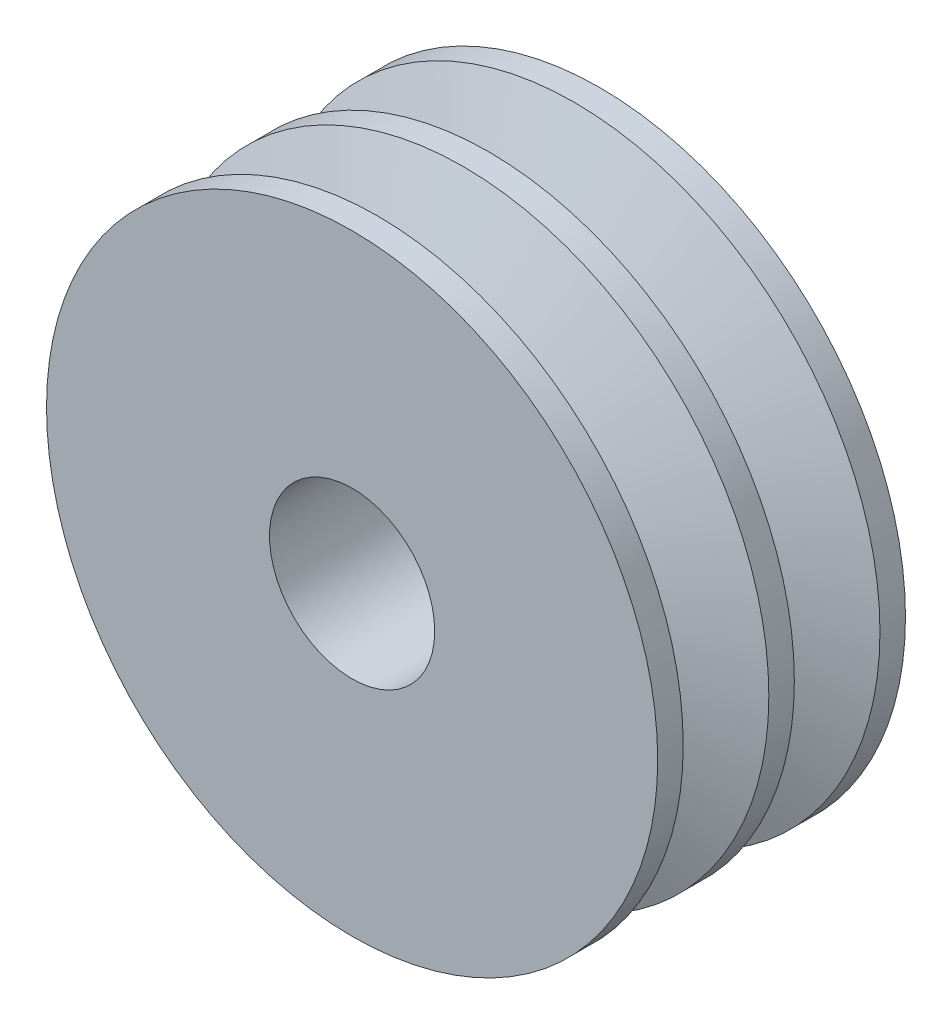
ISO-10303-21;
HEADER;
FILE_DESCRIPTION(('STEP AP214'),'2;1');
FILE_NAME('part.step','',(''),(''),'','','');
FILE_SCHEMA(('AUTOMOTIVE_DESIGN { 1 0 10303 214 1 1 1 1 }'));
ENDSEC;
DATA;
#1=APPLICATION_CONTEXT('core data for automotive mechanical design processes');
#2=APPLICATION_PROTOCOL_DEFINITION('international standard','automotive_design',2000,#1);
#3=PRODUCT_CONTEXT('',#1,'mechanical');
#4=PRODUCT('Part','Part','',(#3));
#5=PRODUCT_RELATED_PRODUCT_CATEGORY('part','',(#4));
#6=PRODUCT_DEFINITION_FORMATION('','',#4);
#7=PRODUCT_DEFINITION_CONTEXT('part definition',#1,'design');
#8=PRODUCT_DEFINITION('design','',#6,#7);
#9=PRODUCT_DEFINITION_SHAPE('','',#8);
#10=(LENGTH_UNIT() NAMED_UNIT(*) SI_UNIT(.MILLI.,.METRE.));
#11=(NAMED_UNIT(*) PLANE_ANGLE_UNIT() SI_UNIT($,.RADIAN.));
#12=(NAMED_UNIT(*) SI_UNIT($,.STERADIAN.) SOLID_ANGLE_UNIT());
#13=UNCERTAINTY_MEASURE_WITH_UNIT(LENGTH_MEASURE(1.E-05),#10,'distance_accuracy_value','');
#14=(GEOMETRIC_REPRESENTATION_CONTEXT(3) GLOBAL_UNCERTAINTY_ASSIGNED_CONTEXT((#13)) GLOBAL_UNIT_ASSIGNED_CONTEXT((#10,
#11,#12)) REPRESENTATION_CONTEXT('',''));
#15=CARTESIAN_POINT('',(0.,0.,0.));
#16=DIRECTION('',(0.,0.,1.));
#17=DIRECTION('',(1.,0.,0.));
#18=AXIS2_PLACEMENT_3D('',#15,#16,#17);
#19=CARTESIAN_POINT('',(0.,0.,3.67693351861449));
#20=DIRECTION('',(0.,0.,-1.));
#21=DIRECTION('',(-1.,0.,0.));
#22=AXIS2_PLACEMENT_3D('',#19,#20,#21);
#23=CONICAL_SURFACE('',#22,88.10625,1.22173047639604);
#24=CARTESIAN_POINT('',(0.,0.,12.3439747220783));
#25=DIRECTION('',(0.,0.,1.));
#26=DIRECTION('',(1.,0.,0.));
#27=AXIS2_PLACEMENT_3D('',#24,#25,#26);
#28=CIRCLE('',#27,64.29375);
#29=CARTESIAN_POINT('',(64.29375,0.,12.3439747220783));
#30=VERTEX_POINT('',#29);
#31=EDGE_CURVE('E10',#30,#30,#28,.T.);
#32=ORIENTED_EDGE('',*,*,#31,.F.);
#33=EDGE_LOOP('',(#32));
#34=FACE_BOUND('',#33,.T.);
#35=CARTESIAN_POINT('',(0.,0.,3.67693351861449));
#36=DIRECTION('',(0.,0.,1.));
#37=DIRECTION('',(1.,0.,0.));
#38=AXIS2_PLACEMENT_3D('',#35,#36,#37);
#39=CIRCLE('',#38,88.10625);
#40=CARTESIAN_POINT('',(88.10625,0.,3.67693351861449));
#41=VERTEX_POINT('',#40);
#42=EDGE_CURVE('E55',#41,#41,#39,.T.);
#43=ORIENTED_EDGE('',*,*,#42,.T.);
#44=EDGE_LOOP('',(#43));
#45=FACE_BOUND('',#44,.T.);
#46=ADVANCED_FACE('F15',(#34,#45),#23,.T.);
#47=CARTESIAN_POINT('',(0.,0.,0.));
#48=DIRECTION('',(0.,0.,1.));
#49=DIRECTION('',(1.,0.,0.));
#50=AXIS2_PLACEMENT_3D('',#47,#48,#49);
#51=CYLINDRICAL_SURFACE('',#50,64.29375);
#52=CARTESIAN_POINT('',(0.,0.,19.6978417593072));
#53=DIRECTION('',(0.,0.,1.));
#54=DIRECTION('',(1.,0.,0.));
#55=AXIS2_PLACEMENT_3D('',#52,#53,#54);
#56=CIRCLE('',#55,64.29375);
#57=CARTESIAN_POINT('',(64.29375,0.,19.6978417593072));
#58=VERTEX_POINT('',#57);
#59=EDGE_CURVE('E21',#58,#58,#56,.T.);
#60=ORIENTED_EDGE('',*,*,#59,.F.);
#61=EDGE_LOOP('',(#60));
#62=FACE_BOUND('',#61,.T.);
#63=ORIENTED_EDGE('',*,*,#31,.T.);
#64=EDGE_LOOP('',(#63));
#65=FACE_BOUND('',#64,.T.);
#66=ADVANCED_FACE('F116',(#62,#65),#51,.T.);
#67=CARTESIAN_POINT('',(0.,0.,19.6978417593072));
#68=DIRECTION('',(0.,0.,1.));
#69=DIRECTION('',(1.,0.,0.));
#70=AXIS2_PLACEMENT_3D('',#67,#68,#69);
#71=CONICAL_SURFACE('',#70,64.29375,1.22173047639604);
#72=CARTESIAN_POINT('',(0.,0.,28.364882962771));
#73=DIRECTION('',(0.,0.,1.));
#74=DIRECTION('',(1.,0.,0.));
#75=AXIS2_PLACEMENT_3D('',#72,#73,#74);
#76=CIRCLE('',#75,88.10625);
#77=CARTESIAN_POINT('',(88.10625,0.,28.364882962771));
#78=VERTEX_POINT('',#77);
#79=EDGE_CURVE('E25',#78,#78,#76,.T.);
#80=ORIENTED_EDGE('',*,*,#79,.F.);
#81=EDGE_LOOP('',(#80));
#82=FACE_BOUND('',#81,.T.);
#83=ORIENTED_EDGE('',*,*,#59,.T.);
#84=EDGE_LOOP('',(#83));
#85=FACE_BOUND('',#84,.T.);
#86=ADVANCED_FACE('F111',(#82,#85),#71,.T.);
#87=CARTESIAN_POINT('',(0.,0.,0.));
#88=DIRECTION('',(0.,0.,1.));
#89=DIRECTION('',(1.,0.,0.));
#90=AXIS2_PLACEMENT_3D('',#87,#88,#89);
#91=CYLINDRICAL_SURFACE('',#90,88.10625);
#92=CARTESIAN_POINT('',(0.,0.,35.71875));
#93=DIRECTION('',(0.,0.,1.));
#94=DIRECTION('',(1.,0.,0.));
#95=AXIS2_PLACEMENT_3D('',#92,#93,#94);
#96=CIRCLE('',#95,88.10625);
#97=CARTESIAN_POINT('',(88.10625,0.,35.71875));
#98=VERTEX_POINT('',#97);
#99=EDGE_CURVE('E29',#98,#98,#96,.T.);
#100=ORIENTED_EDGE('',*,*,#99,.F.);
#101=EDGE_LOOP('',(#100));
#102=FACE_BOUND('',#101,.T.);
#103=ORIENTED_EDGE('',*,*,#79,.T.);
#104=EDGE_LOOP('',(#103));
#105=FACE_BOUND('',#104,.T.);
#106=ADVANCED_FACE('F105',(#102,#105),#91,.T.);
#107=CARTESIAN_POINT('',(0.,23.8125,35.71875));
#108=DIRECTION('',(0.,0.,-1.));
#109=DIRECTION('',(-1.,0.,0.));
#110=AXIS2_PLACEMENT_3D('',#107,#108,#109);
#111=PLANE('',#110);
#112=CARTESIAN_POINT('',(0.,0.,35.71875));
#113=DIRECTION('',(0.,0.,1.));
#114=DIRECTION('',(1.,0.,0.));
#115=AXIS2_PLACEMENT_3D('',#112,#113,#114);
#116=CIRCLE('',#115,23.8125);
#117=CARTESIAN_POINT('',(23.8125,0.,35.71875));
#118=VERTEX_POINT('',#117);
#119=EDGE_CURVE('E34',#118,#118,#116,.T.);
#120=ORIENTED_EDGE('',*,*,#119,.F.);
#121=EDGE_LOOP('',(#120));
#122=FACE_BOUND('',#121,.T.);
#123=ORIENTED_EDGE('',*,*,#99,.T.);
#124=EDGE_LOOP('',(#123));
#125=FACE_BOUND('',#124,.T.);
#126=ADVANCED_FACE('F99',(#122,#125),#111,.F.);
#127=CARTESIAN_POINT('',(0.,0.,0.));
#128=DIRECTION('',(0.,0.,1.));
#129=DIRECTION('',(1.,0.,0.));
#130=AXIS2_PLACEMENT_3D('',#127,#128,#129);
#131=CYLINDRICAL_SURFACE('',#130,23.8125);
#132=CARTESIAN_POINT('',(0.,0.,-35.71875));
#133=DIRECTION('',(0.,0.,1.));
#134=DIRECTION('',(1.,0.,0.));
#135=AXIS2_PLACEMENT_3D('',#132,#133,#134);
#136=CIRCLE('',#135,23.8125);
#137=CARTESIAN_POINT('',(23.8125,0.,-35.71875));
#138=VERTEX_POINT('',#137);
#139=EDGE_CURVE('E37',#138,#138,#136,.T.);
#140=ORIENTED_EDGE('',*,*,#139,.F.);
#141=EDGE_LOOP('',(#140));
#142=FACE_BOUND('',#141,.T.);
#143=ORIENTED_EDGE('',*,*,#119,.T.);
#144=EDGE_LOOP('',(#143));
#145=FACE_BOUND('',#144,.T.);
#146=ADVANCED_FACE('F93',(#142,#145),#131,.F.);
#147=CARTESIAN_POINT('',(0.,23.8125,-35.71875));
#148=DIRECTION('',(0.,0.,1.));
#149=DIRECTION('',(1.,0.,0.));
#150=AXIS2_PLACEMENT_3D('',#147,#148,#149);
#151=PLANE('',#150);
#152=CARTESIAN_POINT('',(0.,0.,-35.71875));
#153=DIRECTION('',(0.,0.,1.));
#154=DIRECTION('',(1.,0.,0.));
#155=AXIS2_PLACEMENT_3D('',#152,#153,#154);
#156=CIRCLE('',#155,88.10625);
#157=CARTESIAN_POINT('',(88.10625,0.,-35.71875));
#158=VERTEX_POINT('',#157);
#159=EDGE_CURVE('E40',#158,#158,#156,.T.);
#160=ORIENTED_EDGE('',*,*,#159,.F.);
#161=EDGE_LOOP('',(#160));
#162=FACE_BOUND('',#161,.T.);
#163=ORIENTED_EDGE('',*,*,#139,.T.);
#164=EDGE_LOOP('',(#163));
#165=FACE_BOUND('',#164,.T.);
#166=ADVANCED_FACE('F87',(#162,#165),#151,.F.);
#167=CARTESIAN_POINT('',(0.,0.,0.));
#168=DIRECTION('',(0.,0.,1.));
#169=DIRECTION('',(1.,0.,0.));
#170=AXIS2_PLACEMENT_3D('',#167,#168,#169);
#171=CYLINDRICAL_SURFACE('',#170,88.10625);
#172=CARTESIAN_POINT('',(0.,0.,-28.364882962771));
#173=DIRECTION('',(0.,0.,1.));
#174=DIRECTION('',(1.,0.,0.));
#175=AXIS2_PLACEMENT_3D('',#172,#173,#174);
#176=CIRCLE('',#175,88.10625);
#177=CARTESIAN_POINT('',(88.10625,0.,-28.364882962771));
#178=VERTEX_POINT('',#177);
#179=EDGE_CURVE('E43',#178,#178,#176,.T.);
#180=ORIENTED_EDGE('',*,*,#179,.F.);
#181=EDGE_LOOP('',(#180));
#182=FACE_BOUND('',#181,.T.);
#183=ORIENTED_EDGE('',*,*,#159,.T.);
#184=EDGE_LOOP('',(#183));
#185=FACE_BOUND('',#184,.T.);
#186=ADVANCED_FACE('F81',(#182,#185),#171,.T.);
#187=CARTESIAN_POINT('',(0.,0.,-28.364882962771));
#188=DIRECTION('',(0.,0.,-1.));
#189=DIRECTION('',(-1.,0.,0.));
#190=AXIS2_PLACEMENT_3D('',#187,#188,#189);
#191=CONICAL_SURFACE('',#190,88.10625,1.22173047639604);
#192=CARTESIAN_POINT('',(0.,0.,-19.6978417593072));
#193=DIRECTION('',(0.,0.,1.));
#194=DIRECTION('',(1.,0.,0.));
#195=AXIS2_PLACEMENT_3D('',#192,#193,#194);
#196=CIRCLE('',#195,64.29375);
#197=CARTESIAN_POINT('',(64.29375,0.,-19.6978417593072));
#198=VERTEX_POINT('',#197);
#199=EDGE_CURVE('E46',#198,#198,#196,.T.);
#200=ORIENTED_EDGE('',*,*,#199,.F.);
#201=EDGE_LOOP('',(#200));
#202=FACE_BOUND('',#201,.T.);
#203=ORIENTED_EDGE('',*,*,#179,.T.);
#204=EDGE_LOOP('',(#203));
#205=FACE_BOUND('',#204,.T.);
#206=ADVANCED_FACE('F75',(#202,#205),#191,.T.);
#207=CARTESIAN_POINT('',(0.,0.,0.));
#208=DIRECTION('',(0.,0.,1.));
#209=DIRECTION('',(1.,0.,0.));
#210=AXIS2_PLACEMENT_3D('',#207,#208,#209);
#211=CYLINDRICAL_SURFACE('',#210,64.29375);
#212=CARTESIAN_POINT('',(0.,0.,-12.3439747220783));
#213=DIRECTION('',(0.,0.,1.));
#214=DIRECTION('',(1.,0.,0.));
#215=AXIS2_PLACEMENT_3D('',#212,#213,#214);
#216=CIRCLE('',#215,64.29375);
#217=CARTESIAN_POINT('',(64.29375,0.,-12.3439747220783));
#218=VERTEX_POINT('',#217);
#219=EDGE_CURVE('E49',#218,#218,#216,.T.);
#220=ORIENTED_EDGE('',*,*,#219,.F.);
#221=EDGE_LOOP('',(#220));
#222=FACE_BOUND('',#221,.T.);
#223=ORIENTED_EDGE('',*,*,#199,.T.);
#224=EDGE_LOOP('',(#223));
#225=FACE_BOUND('',#224,.T.);
#226=ADVANCED_FACE('F69',(#222,#225),#211,.T.);
#227=CARTESIAN_POINT('',(0.,0.,-12.3439747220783));
#228=DIRECTION('',(0.,0.,1.));
#229=DIRECTION('',(1.,0.,0.));
#230=AXIS2_PLACEMENT_3D('',#227,#228,#229);
#231=CONICAL_SURFACE('',#230,64.29375,1.22173047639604);
#232=CARTESIAN_POINT('',(0.,0.,-3.67693351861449));
#233=DIRECTION('',(0.,0.,1.));
#234=DIRECTION('',(1.,0.,0.));
#235=AXIS2_PLACEMENT_3D('',#232,#233,#234);
#236=CIRCLE('',#235,88.10625);
#237=CARTESIAN_POINT('',(88.10625,0.,-3.67693351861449));
#238=VERTEX_POINT('',#237);
#239=EDGE_CURVE('E52',#238,#238,#236,.T.);
#240=ORIENTED_EDGE('',*,*,#239,.F.);
#241=EDGE_LOOP('',(#240));
#242=FACE_BOUND('',#241,.T.);
#243=ORIENTED_EDGE('',*,*,#219,.T.);
#244=EDGE_LOOP('',(#243));
#245=FACE_BOUND('',#244,.T.);
#246=ADVANCED_FACE('F63',(#242,#245),#231,.T.);
#247=CARTESIAN_POINT('',(0.,0.,0.));
#248=DIRECTION('',(0.,0.,1.));
#249=DIRECTION('',(1.,0.,0.));
#250=AXIS2_PLACEMENT_3D('',#247,#248,#249);
#251=CYLINDRICAL_SURFACE('',#250,88.10625);
#252=ORIENTED_EDGE('',*,*,#42,.F.);
#253=EDGE_LOOP('',(#252));
#254=FACE_BOUND('',#253,.T.);
#255=ORIENTED_EDGE('',*,*,#239,.T.);
#256=EDGE_LOOP('',(#255));
#257=FACE_BOUND('',#256,.T.);
#258=ADVANCED_FACE('F60',(#254,#257),#251,.T.);
#259=CLOSED_SHELL('',(#46,#66,#86,#106,#126,#146,#166,#186,#206,#226,#246,#258));
#260=MANIFOLD_SOLID_BREP('B1',#259);
#261=ADVANCED_BREP_SHAPE_REPRESENTATION('',(#18,#260),#14);
#262=SHAPE_DEFINITION_REPRESENTATION(#9,#261);
ENDSEC;
END-ISO-10303-21;
